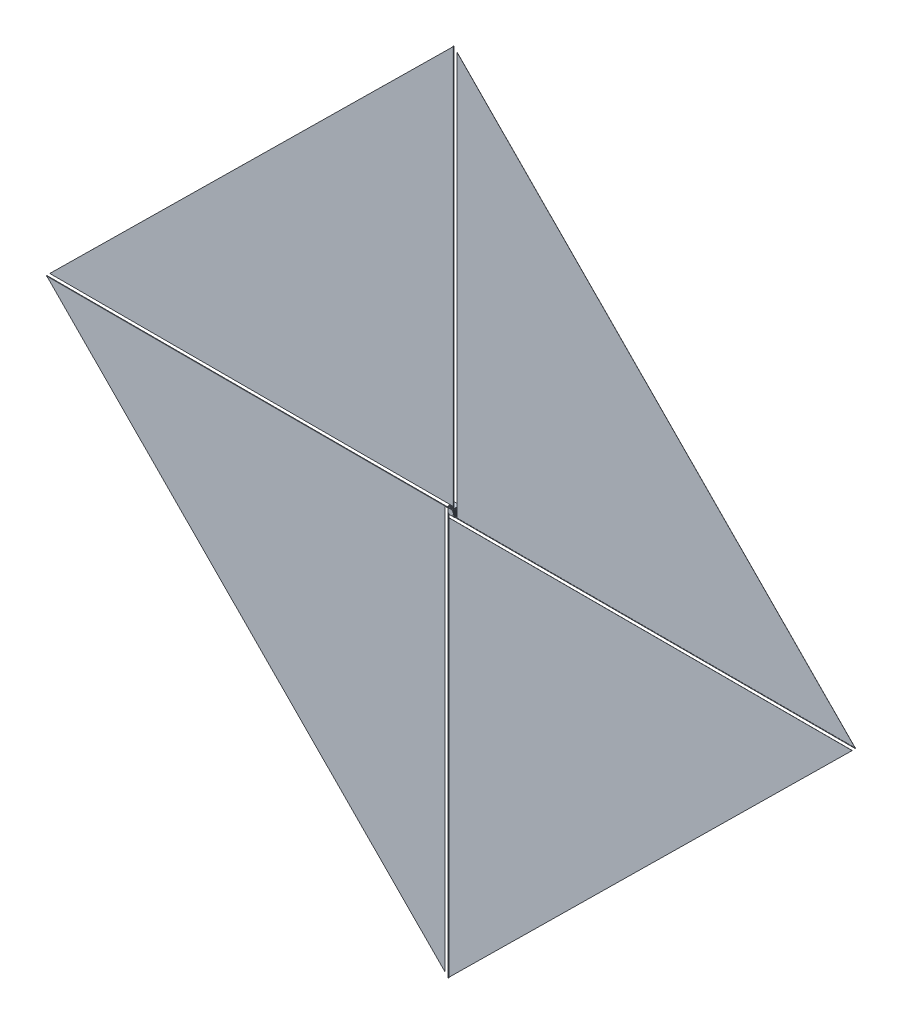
from build123d import *

# Parameters (mm, degrees)
SKETCH1_W           = 250
SKETCH1_H           = 250
BOSS_EXTRUDE1_DEPTH = 250
SKETCH2_W           = 200
SKETCH2_H           = 200
BOSS_EXTRUDE2_DEPTH = 25
CIRPATTERN1_COUNT   = 4
SKETCH5_W           = 100
SKETCH5_H           = 25
SKETCH6_W           = 15
SKETCH6_H           = 15
BOSS_EXTRUDE4_DEPTH = 15000
CIRPATTERN2_COUNT   = 4
BOSS_EXTRUDE5_START = -6
BOSS_EXTRUDE5_DEPTH = 4
CIRPATTERN3_COUNT   = 4
SCALE1_SCALE        = 0.5


with BuildPart() as part:
    # Sketch1 → Boss-Extrude1 (new body)
    with BuildSketch(Plane.XY):
        with Locations((125, 125)):
            Rectangle(SKETCH1_W, SKETCH1_H)
    extrude(amount=BOSS_EXTRUDE1_DEPTH)

    # Sketch2 → Boss-Extrude2 (add)
    with BuildSketch(Plane(origin=(0, 250, 0), x_dir=(1, 0, 0), z_dir=(0, 1, 0))):
        with Locations((125, -125)):
            Rectangle(SKETCH2_W, SKETCH2_H)
    boss_extrude2 = extrude(amount=BOSS_EXTRUDE2_DEPTH)

    # CirPattern1: Boss-Extrude2 ×4 about axis
    cirpattern1_axis = Axis((125, 125, 0), (0, 0, 1))
    for i in range(1, CIRPATTERN1_COUNT):
        add(boss_extrude2.rotate(cirpattern1_axis, i * 360 / CIRPATTERN1_COUNT))

    # Sketch5 → Revolve1 (revolve)
    with BuildSketch(Plane(origin=(0, 125, 0), x_dir=(1, 0, 0), z_dir=(0, 1, 0)), mode=Mode.PRIVATE) as revolve1_sk:
        with Locations((175, -262.5)):
            Rectangle(SKETCH5_W, SKETCH5_H)
    revolve(revolve1_sk.sketch.rotate(Axis((125, 125, 250), (0, 0, 1)), 180), axis=Axis((125, 125, 250), (0, 0, 1)))

    # Sketch6 → Boss-Extrude4 (add)
    with BuildSketch(Plane(origin=(0, 125, 0), x_dir=(1, 0, 0), z_dir=(0, 1, 0))):
        with Locations((212.5, -262.5)):
            Rectangle(SKETCH6_W, SKETCH6_H)
    boss_extrude4 = extrude(amount=BOSS_EXTRUDE4_DEPTH)

    # CirPattern2: Boss-Extrude4 ×4 about axis
    cirpattern2_axis = Axis((125, 125, 0), (0, 0, 1))
    for i in range(1, CIRPATTERN2_COUNT):
        add(boss_extrude4.rotate(cirpattern2_axis, i * 360 / CIRPATTERN2_COUNT))

    # Sketch7 → Boss-Extrude5 (add)
    with BuildSketch(Plane.XY.offset(270).offset(BOSS_EXTRUDE5_START)):
        Polygon((-14857.529890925, 205), (-97.7218313, -14749.95626699), (-97.7218313, 205), align=None)
    boss_extrude5 = extrude(amount=-BOSS_EXTRUDE5_DEPTH)

    # CirPattern3: Boss-Extrude5 ×4 about axis
    cirpattern3_axis = Axis((125, 125, 0), (0, 0, 1))
    for i in range(1, CIRPATTERN3_COUNT):
        add(boss_extrude5.rotate(cirpattern3_axis, i * 360 / CIRPATTERN3_COUNT))


with BuildPart() as part_1:
    # Scale1: scaled about (125, 125, 260.51004884)
    add(part.part.scale(SCALE1_SCALE).moved(Location((62.5, 62.5, 130.25502442))))


solid = part_1.part
